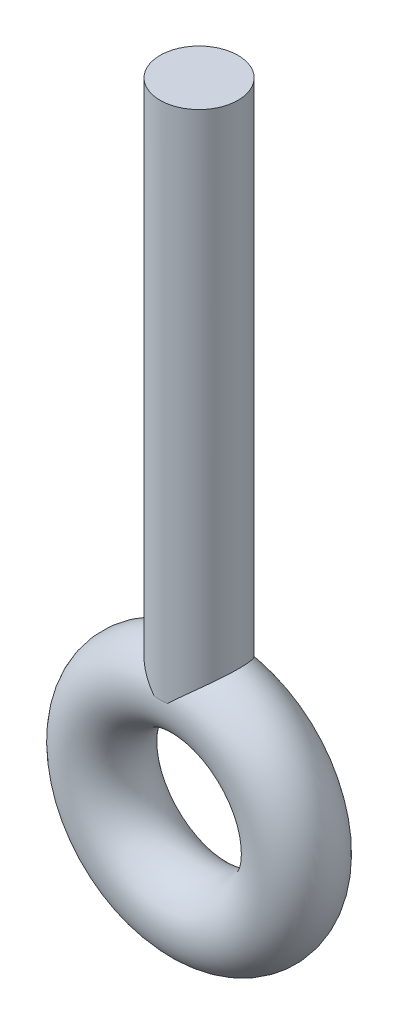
ISO-10303-21;
HEADER;
FILE_DESCRIPTION(('STEP AP214'),'2;1');
FILE_NAME('part.step','',(''),(''),'','','');
FILE_SCHEMA(('AUTOMOTIVE_DESIGN { 1 0 10303 214 1 1 1 1 }'));
ENDSEC;
DATA;
#1=APPLICATION_CONTEXT('core data for automotive mechanical design processes');
#2=APPLICATION_PROTOCOL_DEFINITION('international standard','automotive_design',2000,#1);
#3=PRODUCT_CONTEXT('',#1,'mechanical');
#4=PRODUCT('Part','Part','',(#3));
#5=PRODUCT_RELATED_PRODUCT_CATEGORY('part','',(#4));
#6=PRODUCT_DEFINITION_FORMATION('','',#4);
#7=PRODUCT_DEFINITION_CONTEXT('part definition',#1,'design');
#8=PRODUCT_DEFINITION('design','',#6,#7);
#9=PRODUCT_DEFINITION_SHAPE('','',#8);
#10=(LENGTH_UNIT() NAMED_UNIT(*) SI_UNIT(.MILLI.,.METRE.));
#11=(NAMED_UNIT(*) PLANE_ANGLE_UNIT() SI_UNIT($,.RADIAN.));
#12=(NAMED_UNIT(*) SI_UNIT($,.STERADIAN.) SOLID_ANGLE_UNIT());
#13=UNCERTAINTY_MEASURE_WITH_UNIT(LENGTH_MEASURE(1.E-05),#10,'distance_accuracy_value','');
#14=(GEOMETRIC_REPRESENTATION_CONTEXT(3) GLOBAL_UNCERTAINTY_ASSIGNED_CONTEXT((#13)) GLOBAL_UNIT_ASSIGNED_CONTEXT((#10,
#11,#12)) REPRESENTATION_CONTEXT('',''));
#15=CARTESIAN_POINT('',(0.,0.,0.));
#16=DIRECTION('',(0.,0.,1.));
#17=DIRECTION('',(1.,0.,0.));
#18=AXIS2_PLACEMENT_3D('',#15,#16,#17);
#19=CARTESIAN_POINT('',(0.,8.,0.));
#20=DIRECTION('',(0.,1.,0.));
#21=DIRECTION('',(0.,0.,1.));
#22=AXIS2_PLACEMENT_3D('',#19,#20,#21);
#23=PLANE('',#22);
#24=CARTESIAN_POINT('',(0.,8.,2.95803989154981));
#25=CARTESIAN_POINT('',(-0.247460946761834,8.,2.95804711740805));
#26=CARTESIAN_POINT('',(-0.49492265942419,8.,2.95616386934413));
#27=CARTESIAN_POINT('',(-0.989773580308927,8.,2.94788561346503));
#28=CARTESIAN_POINT('',(-1.23716279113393,8.,2.94149079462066));
#29=CARTESIAN_POINT('',(-1.60776807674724,8.,2.92679903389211));
#30=CARTESIAN_POINT('',(-1.731082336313,8.,2.92106134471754));
#31=CARTESIAN_POINT('',(-1.97758381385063,8.,2.90746047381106));
#32=CARTESIAN_POINT('',(-2.10077103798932,8.,2.89959740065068));
#33=CARTESIAN_POINT('',(-2.46998876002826,8.,2.87212468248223));
#34=CARTESIAN_POINT('',(-2.71577107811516,8.,2.84862845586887));
#35=CARTESIAN_POINT('',(-3.12136668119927,8.,2.79714191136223));
#36=CARTESIAN_POINT('',(-3.28172002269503,8.,2.77346517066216));
#37=CARTESIAN_POINT('',(-3.60098801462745,8.,2.71792496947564));
#38=CARTESIAN_POINT('',(-3.75990307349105,8.,2.68606391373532));
#39=CARTESIAN_POINT('',(-4.07526568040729,8.,2.61236064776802));
#40=CARTESIAN_POINT('',(-4.23171575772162,8.,2.57052948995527));
#41=CARTESIAN_POINT('',(-4.54085538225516,8.,2.47487456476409));
#42=CARTESIAN_POINT('',(-4.69354717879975,8.,2.42105817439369));
#43=CARTESIAN_POINT('',(-5.02114932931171,8.,2.28793160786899));
#44=CARTESIAN_POINT('',(-5.19492044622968,8.,2.20574311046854));
#45=CARTESIAN_POINT('',(-5.52939647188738,8.,2.01780762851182));
#46=CARTESIAN_POINT('',(-5.69011477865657,8.,1.91208522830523));
#47=CARTESIAN_POINT('',(-5.95753271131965,8.,1.70059309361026));
#48=CARTESIAN_POINT('',(-6.06831082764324,8.,1.60002476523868));
#49=CARTESIAN_POINT('',(-6.27238605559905,8.,1.38240612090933));
#50=CARTESIAN_POINT('',(-6.36570690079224,8.,1.26537856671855));
#51=CARTESIAN_POINT('',(-6.51329983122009,8.,1.04010634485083));
#52=CARTESIAN_POINT('',(-6.57163288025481,8.,0.934533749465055));
#53=CARTESIAN_POINT('',(-6.67002120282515,8.,0.715134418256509));
#54=CARTESIAN_POINT('',(-6.71008623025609,8.,0.601312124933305));
#55=CARTESIAN_POINT('',(-6.7694642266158,8.,0.367665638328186));
#56=CARTESIAN_POINT('',(-6.78866633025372,8.,0.247812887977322));
#57=CARTESIAN_POINT('',(-6.80446971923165,8.,0.00662180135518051));
#58=CARTESIAN_POINT('',(-6.80107644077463,8.,-0.114716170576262));
#59=CARTESIAN_POINT('',(-6.77326925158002,8.,-0.344084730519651));
#60=CARTESIAN_POINT('',(-6.75072472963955,8.,-0.452349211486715));
#61=CARTESIAN_POINT('',(-6.68849017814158,8.,-0.663777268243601));
#62=CARTESIAN_POINT('',(-6.64880041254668,8.,-0.766940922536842));
#63=CARTESIAN_POINT('',(-6.55241367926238,8.,-0.970289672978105));
#64=CARTESIAN_POINT('',(-6.49506970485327,8.,-1.07016536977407));
#65=CARTESIAN_POINT('',(-6.36682471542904,8.,-1.26077000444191));
#66=CARTESIAN_POINT('',(-6.29591319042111,8.,-1.35149176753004));
#67=CARTESIAN_POINT('',(-6.10249444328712,8.,-1.5689667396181));
#68=CARTESIAN_POINT('',(-5.97262185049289,8.,-1.68917707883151));
#69=CARTESIAN_POINT('',(-5.69547750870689,8.,-1.90730054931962));
#70=CARTESIAN_POINT('',(-5.54817808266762,8.,-2.00517746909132));
#71=CARTESIAN_POINT('',(-5.27463351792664,8.,-2.16223273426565));
#72=CARTESIAN_POINT('',(-5.1505221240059,8.,-2.22521772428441));
#73=CARTESIAN_POINT('',(-4.89720959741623,8.,-2.34010688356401));
#74=CARTESIAN_POINT('',(-4.76800491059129,8.,-2.39200314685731));
#75=CARTESIAN_POINT('',(-4.50575508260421,8.,-2.48618961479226));
#76=CARTESIAN_POINT('',(-4.37269965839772,8.,-2.52845077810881));
#77=CARTESIAN_POINT('',(-4.10430734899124,8.,-2.60450190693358));
#78=CARTESIAN_POINT('',(-3.96897180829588,8.,-2.6382966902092));
#79=CARTESIAN_POINT('',(-3.60023653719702,8.,-2.72014870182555));
#80=CARTESIAN_POINT('',(-3.36532021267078,8.,-2.76133707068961));
#81=CARTESIAN_POINT('',(-2.89325855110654,8.,-2.82842060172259));
#82=CARTESIAN_POINT('',(-2.65611139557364,8.,-2.85430194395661));
#83=CARTESIAN_POINT('',(-2.18011166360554,8.,-2.89539352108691));
#84=CARTESIAN_POINT('',(-1.94125602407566,8.,-2.91056627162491));
#85=CARTESIAN_POINT('',(-1.46330724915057,8.,-2.93368425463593));
#86=CARTESIAN_POINT('',(-1.22421421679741,8.,-2.94163184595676));
#87=CARTESIAN_POINT('',(-0.743847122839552,8.,-2.9527968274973));
#88=CARTESIAN_POINT('',(-0.502572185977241,8.,-2.95597245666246));
#89=CARTESIAN_POINT('',(-0.0199792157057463,8.,-2.95865902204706));
#90=CARTESIAN_POINT('',(0.221338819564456,8.,-2.95816957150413));
#91=CARTESIAN_POINT('',(0.70344713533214,8.,-2.95333444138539));
#92=CARTESIAN_POINT('',(0.944237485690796,8.,-2.94899665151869));
#93=CARTESIAN_POINT('',(1.42564383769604,8.,-2.93491469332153));
#94=CARTESIAN_POINT('',(1.66625985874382,8.,-2.92517126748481));
#95=CARTESIAN_POINT('',(2.14569930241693,8.,-2.89752531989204));
#96=CARTESIAN_POINT('',(2.38452518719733,8.,-2.8796690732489));
#97=CARTESIAN_POINT('',(2.86124761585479,8.,-2.83187784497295));
#98=CARTESIAN_POINT('',(3.09914322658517,8.,-2.80193287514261));
#99=CARTESIAN_POINT('',(3.56967012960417,8.,-2.72542663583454));
#100=CARTESIAN_POINT('',(3.8023305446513,8.,-2.67905220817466));
#101=CARTESIAN_POINT('',(4.26192487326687,8.,-2.56393752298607));
#102=CARTESIAN_POINT('',(4.48886813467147,8.,-2.49523672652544));
#103=CARTESIAN_POINT('',(4.86544771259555,8.,-2.35392675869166));
#104=CARTESIAN_POINT('',(5.01782302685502,8.,-2.2886947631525));
#105=CARTESIAN_POINT('',(5.31488130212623,8.,-2.14151619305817));
#106=CARTESIAN_POINT('',(5.45954577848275,8.,-2.05953154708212));
#107=CARTESIAN_POINT('',(5.73784718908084,8.,-1.8759752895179));
#108=CARTESIAN_POINT('',(5.87138064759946,8.,-1.77424407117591));
#109=CARTESIAN_POINT('',(6.11992064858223,8.,-1.55023382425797));
#110=CARTESIAN_POINT('',(6.23496748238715,8.,-1.42800070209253));
#111=CARTESIAN_POINT('',(6.41264946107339,8.,-1.19761963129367));
#112=CARTESIAN_POINT('',(6.4811444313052,8.,-1.09400485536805));
#113=CARTESIAN_POINT('',(6.60039535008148,8.,-0.87693884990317));
#114=CARTESIAN_POINT('',(6.65115958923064,8.,-0.76349224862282));
#115=CARTESIAN_POINT('',(6.73197157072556,8.,-0.528491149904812));
#116=CARTESIAN_POINT('',(6.76187746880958,8.,-0.406887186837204));
#117=CARTESIAN_POINT('',(6.79808596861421,8.,-0.160207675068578));
#118=CARTESIAN_POINT('',(6.80440053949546,8.,-0.0351339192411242));
#119=CARTESIAN_POINT('',(6.79356008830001,8.,0.200775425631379));
#120=CARTESIAN_POINT('',(6.77879605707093,8.,0.311729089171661));
#121=CARTESIAN_POINT('',(6.73097486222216,8.,0.529580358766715));
#122=CARTESIAN_POINT('',(6.69791817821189,8.,0.636478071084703));
#123=CARTESIAN_POINT('',(6.6150792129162,8.,0.844632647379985));
#124=CARTESIAN_POINT('',(6.56514823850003,8.,0.945829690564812));
#125=CARTESIAN_POINT('',(6.45116096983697,8.,1.13988097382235));
#126=CARTESIAN_POINT('',(6.38709704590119,8.,1.23273066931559));
#127=CARTESIAN_POINT('',(6.21446603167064,8.,1.45085834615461));
#128=CARTESIAN_POINT('',(6.09915290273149,8.,1.57080194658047));
#129=CARTESIAN_POINT('',(5.85077918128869,8.,1.79061235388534));
#130=CARTESIAN_POINT('',(5.71768391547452,8.,1.89043895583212));
#131=CARTESIAN_POINT('',(5.47280767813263,8.,2.04974334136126));
#132=CARTESIAN_POINT('',(5.36353175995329,8.,2.11316288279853));
#133=CARTESIAN_POINT('',(5.13979135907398,8.,2.23018643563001));
#134=CARTESIAN_POINT('',(5.02532374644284,8.,2.28378442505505));
#135=CARTESIAN_POINT('',(4.79250469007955,8.,2.38222673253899));
#136=CARTESIAN_POINT('',(4.67414714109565,8.,2.42705643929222));
#137=CARTESIAN_POINT('',(4.43483223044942,8.,2.50888202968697));
#138=CARTESIAN_POINT('',(4.31387580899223,8.,2.54588069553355));
#139=CARTESIAN_POINT('',(4.02321226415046,8.,2.62599579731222));
#140=CARTESIAN_POINT('',(3.8526491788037,8.,2.66599136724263));
#141=CARTESIAN_POINT('',(3.50934978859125,8.,2.73539836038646));
#142=CARTESIAN_POINT('',(3.33661230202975,8.,2.76480374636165));
#143=CARTESIAN_POINT('',(2.98953899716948,8.,2.81524361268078));
#144=CARTESIAN_POINT('',(2.81520039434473,8.,2.83625844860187));
#145=CARTESIAN_POINT('',(2.46591102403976,8.,2.8717230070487));
#146=CARTESIAN_POINT('',(2.29096036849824,8.,2.88617387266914));
#147=CARTESIAN_POINT('',(1.93972593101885,8.,2.91019183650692));
#148=CARTESIAN_POINT('',(1.76344027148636,8.,2.91973034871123));
#149=CARTESIAN_POINT('',(1.41071151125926,8.,2.93510926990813));
#150=CARTESIAN_POINT('',(1.23426840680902,8.,2.94094958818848));
#151=CARTESIAN_POINT('',(0.881533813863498,8.,2.94989268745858));
#152=CARTESIAN_POINT('',(0.705242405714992,8.,2.9529988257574));
#153=CARTESIAN_POINT('',(0.352634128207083,8.,2.95706986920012));
#154=CARTESIAN_POINT('',(0.176317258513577,8.,2.95803474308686));
#155=CARTESIAN_POINT('',(0.,8.,2.95803989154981));
#156=B_SPLINE_CURVE_WITH_KNOTS('',3,(#24,#25,#26,#27,#28,#29,#30,#31,#32,#33,#34,#35,#36,#37,
#38,#39,#40,#41,#42,#43,#44,#45,#46,#47,#48,#49,#50,#51,#52,#53,#54,#55,#56,#57,#58,#59,#60,#61,
#62,#63,#64,#65,#66,#67,#68,#69,#70,#71,#72,#73,#74,#75,#76,#77,#78,#79,#80,#81,#82,#83,#84,#85,
#86,#87,#88,#89,#90,#91,#92,#93,#94,#95,#96,#97,#98,#99,#100,#101,#102,#103,#104,#105,#106,#107,
#108,#109,#110,#111,#112,#113,#114,#115,#116,#117,#118,#119,#120,#121,#122,#123,#124,#125,#126,
#127,#128,#129,#130,#131,#132,#133,#134,#135,#136,#137,#138,#139,#140,#141,#142,#143,#144,#145,
#146,#147,#148,#149,#150,#151,#152,#153,#154,#155),.UNSPECIFIED.,.T.,.F.,(4,2,2,2,2,2,2,2,2,2,2,
2,2,2,2,2,2,2,2,2,2,2,2,2,2,2,2,2,2,2,2,2,2,2,2,2,2,2,2,2,2,2,2,2,2,2,2,2,2,2,2,2,2,2,2,2,2,2,2,
2,2,2,2,2,2,4),(0.,0.742377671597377,1.48472424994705,1.85504950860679,2.22535585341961,
2.96568123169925,3.45179511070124,3.93776632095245,4.42320129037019,4.90833829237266,
5.48356135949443,6.05818632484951,6.50548354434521,6.95216816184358,7.31254439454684,
7.67272798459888,8.03481636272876,8.39681762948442,8.72707505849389,9.05732740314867,
9.40151600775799,9.7459723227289,10.2738794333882,10.8026365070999,11.2195910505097,
11.6368418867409,12.0553342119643,12.4735878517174,13.1882955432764,13.9036475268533,
14.621491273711,15.3391005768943,16.0629540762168,16.7868839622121,17.5093330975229,
18.2316830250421,18.9499634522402,19.668838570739,20.3797877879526,21.0894872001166,
21.5859374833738,22.0835287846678,22.5853233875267,23.0860090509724,23.457203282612,
23.8282237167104,24.2017432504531,24.5750732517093,24.9092659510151,25.2434498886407,
25.5806588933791,25.9180503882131,26.4144159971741,26.911763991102,27.2902853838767,
27.6690380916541,28.0484166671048,28.427660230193,28.9527782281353,29.4781951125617,
30.0048350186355,30.5313831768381,31.0609617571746,31.590553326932,32.1194936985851,
32.6484417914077),.UNSPECIFIED.);
#157=CARTESIAN_POINT('',(-0.516666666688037,8.,-2.95517436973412));
#158=VERTEX_POINT('',#157);
#159=CARTESIAN_POINT('',(0.516666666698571,8.,-2.95517436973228));
#160=VERTEX_POINT('',#159);
#161=EDGE_CURVE('E11',#158,#160,#156,.T.);
#162=ORIENTED_EDGE('',*,*,#161,.F.);
#163=CARTESIAN_POINT('',(0.,8.,0.));
#164=DIRECTION('',(0.,1.,0.));
#165=DIRECTION('',(0.,0.,1.));
#166=AXIS2_PLACEMENT_3D('',#163,#164,#165);
#167=CIRCLE('',#166,3.);
#168=EDGE_CURVE('E85',#160,#158,#167,.T.);
#169=ORIENTED_EDGE('',*,*,#168,.F.);
#170=EDGE_LOOP('',(#162,#169));
#171=FACE_BOUND('',#170,.T.);
#172=ADVANCED_FACE('F37',(#171),#23,.F.);
#173=CARTESIAN_POINT('',(0.,48.,0.));
#174=DIRECTION('',(0.,-1.,0.));
#175=DIRECTION('',(0.,0.,-1.));
#176=AXIS2_PLACEMENT_3D('',#173,#174,#175);
#177=CYLINDRICAL_SURFACE('',#176,3.);
#178=CARTESIAN_POINT('',(0.516453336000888,7.99980000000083,-2.95521165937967));
#179=CARTESIAN_POINT('',(0.608004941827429,8.08563367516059,-2.93919241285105));
#180=CARTESIAN_POINT('',(0.699806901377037,8.17031465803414,-2.9187792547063));
#181=CARTESIAN_POINT('',(0.883410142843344,8.33715369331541,-2.86857108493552));
#182=CARTESIAN_POINT('',(0.975211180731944,8.41930741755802,-2.83876086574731));
#183=CARTESIAN_POINT('',(1.25073421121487,8.66240561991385,-2.73393456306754));
#184=CARTESIAN_POINT('',(1.43322654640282,8.81872902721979,-2.64373825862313));
#185=CARTESIAN_POINT('',(1.74150824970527,9.07661492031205,-2.44779812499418));
#186=CARTESIAN_POINT('',(1.87008404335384,9.182108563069,-2.3515495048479));
#187=CARTESIAN_POINT('',(2.11493421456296,9.37996427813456,-2.13394159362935));
#188=CARTESIAN_POINT('',(2.23125118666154,9.47237223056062,-2.01267389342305));
#189=CARTESIAN_POINT('',(2.42810748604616,9.62686718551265,-1.76769344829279));
#190=CARTESIAN_POINT('',(2.51137936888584,9.69144089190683,-1.64774749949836));
#191=CARTESIAN_POINT('',(2.66170556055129,9.80708592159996,-1.391856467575));
#192=CARTESIAN_POINT('',(2.72875620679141,9.85815419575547,-1.25590778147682));
#193=CARTESIAN_POINT('',(2.81431400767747,9.92296224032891,-1.04193621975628));
#194=CARTESIAN_POINT('',(2.84040225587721,9.94265263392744,-0.968631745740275));
#195=CARTESIAN_POINT('',(2.88701602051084,9.97775269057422,-0.819294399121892));
#196=CARTESIAN_POINT('',(2.9075442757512,9.99316446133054,-0.743262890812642));
#197=CARTESIAN_POINT('',(2.94265275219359,10.0194793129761,-0.589101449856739));
#198=CARTESIAN_POINT('',(2.95723530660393,10.0303841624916,-0.510972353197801));
#199=CARTESIAN_POINT('',(2.98018674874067,10.047530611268,-0.353330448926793));
#200=CARTESIAN_POINT('',(2.98855643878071,10.0537728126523,-0.27381782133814));
#201=CARTESIAN_POINT('',(3.00281617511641,10.0644082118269,-0.0534249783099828));
#202=CARTESIAN_POINT('',(3.00200186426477,10.0638014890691,0.0882248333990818));
#203=CARTESIAN_POINT('',(2.98054788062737,10.0477994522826,0.369048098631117));
#204=CARTESIAN_POINT('',(2.95991277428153,10.0324075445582,0.508222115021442));
#205=CARTESIAN_POINT('',(2.90117169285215,9.98839501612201,0.775410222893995));
#206=CARTESIAN_POINT('',(2.86369771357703,9.96025265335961,0.903644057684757));
#207=CARTESIAN_POINT('',(2.77346075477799,9.89207099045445,1.15121467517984));
#208=CARTESIAN_POINT('',(2.72069432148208,9.85202900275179,1.27054944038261));
#209=CARTESIAN_POINT('',(2.59768610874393,9.75795375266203,1.50702626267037));
#210=CARTESIAN_POINT('',(2.52641246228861,9.70308130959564,1.62329388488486));
#211=CARTESIAN_POINT('',(2.37199445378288,9.58298120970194,1.84161732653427));
#212=CARTESIAN_POINT('',(2.28884672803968,9.51775061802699,1.94366910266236));
#213=CARTESIAN_POINT('',(2.07723516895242,9.34976800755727,2.17217363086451));
#214=CARTESIAN_POINT('',(1.94425264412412,9.2426560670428,2.2912601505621));
#215=CARTESIAN_POINT('',(1.66693276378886,9.01482356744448,2.50033047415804));
#216=CARTESIAN_POINT('',(1.52255777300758,8.89405727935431,2.59021233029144));
#217=CARTESIAN_POINT('',(1.23438379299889,8.64755832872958,2.73888870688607));
#218=CARTESIAN_POINT('',(1.09080455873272,8.52223318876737,2.7988081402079));
#219=CARTESIAN_POINT('',(0.803303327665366,8.26535847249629,2.89437704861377));
#220=CARTESIAN_POINT('',(0.659393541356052,8.13386757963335,2.9302193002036));
#221=CARTESIAN_POINT('',(0.516453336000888,7.99980000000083,2.95521165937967));
#222=B_SPLINE_CURVE_WITH_KNOTS('',3,(#178,#179,#180,#181,#182,#183,#184,#185,#186,#187,#188,
#189,#190,#191,#192,#193,#194,#195,#196,#197,#198,#199,#200,#201,#202,#203,#204,#205,#206,#207,
#208,#209,#210,#211,#212,#213,#214,#215,#216,#217,#218,#219,#220,#221),.UNSPECIFIED.,.F.,.F.,(4,
2,2,2,2,2,2,2,2,2,2,2,2,2,2,2,2,2,2,2,2,4),(0.,0.379343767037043,0.759304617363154,
1.52473936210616,2.09918095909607,2.67155578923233,3.14865851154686,3.62586885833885,
3.86635774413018,4.10672795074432,4.34700374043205,4.58724849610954,5.0098499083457,
5.43235398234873,5.84017682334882,6.24809184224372,6.68737783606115,7.12678851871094,
7.74794672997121,8.37125055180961,8.96896149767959,9.5618278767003),.UNSPECIFIED.);
#223=CARTESIAN_POINT('',(0.516666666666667,8.,2.95517436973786));
#224=VERTEX_POINT('',#223);
#225=EDGE_CURVE('E42',#160,#224,#222,.T.);
#226=ORIENTED_EDGE('',*,*,#225,.F.);
#227=ORIENTED_EDGE('',*,*,#168,.T.);
#228=CARTESIAN_POINT('',(-0.516453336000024,7.99980000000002,2.95521165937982));
#229=CARTESIAN_POINT('',(-0.608004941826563,8.08563367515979,2.93919241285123));
#230=CARTESIAN_POINT('',(-0.699806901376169,8.17031465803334,2.91877925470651));
#231=CARTESIAN_POINT('',(-0.883410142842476,8.33715369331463,2.86857108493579));
#232=CARTESIAN_POINT('',(-0.975211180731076,8.41930741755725,2.83876086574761));
#233=CARTESIAN_POINT('',(-1.25073421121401,8.66240561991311,2.73393456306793));
#234=CARTESIAN_POINT('',(-1.43322654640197,8.81872902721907,2.64373825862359));
#235=CARTESIAN_POINT('',(-1.74150824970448,9.07661492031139,2.44779812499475));
#236=CARTESIAN_POINT('',(-1.8700840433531,9.18210856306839,2.35154950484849));
#237=CARTESIAN_POINT('',(-2.11493421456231,9.37996427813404,2.13394159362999));
#238=CARTESIAN_POINT('',(-2.23125118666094,9.47237223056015,2.01267389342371));
#239=CARTESIAN_POINT('',(-2.42810748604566,9.62686718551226,1.76769344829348));
#240=CARTESIAN_POINT('',(-2.51137936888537,9.69144089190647,1.64774749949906));
#241=CARTESIAN_POINT('',(-2.66170556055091,9.80708592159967,1.39185646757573));
#242=CARTESIAN_POINT('',(-2.72875620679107,9.85815419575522,1.25590778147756));
#243=CARTESIAN_POINT('',(-2.8143140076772,9.9229622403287,1.04193621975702));
#244=CARTESIAN_POINT('',(-2.84040225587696,9.94265263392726,0.968631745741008));
#245=CARTESIAN_POINT('',(-2.88701602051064,9.97775269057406,0.81929439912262));
#246=CARTESIAN_POINT('',(-2.90754427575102,9.99316446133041,0.743262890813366));
#247=CARTESIAN_POINT('',(-2.94265275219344,10.019479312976,0.589101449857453));
#248=CARTESIAN_POINT('',(-2.95723530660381,10.0303841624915,0.510972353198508));
#249=CARTESIAN_POINT('',(-2.98018674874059,10.047530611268,0.353330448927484));
#250=CARTESIAN_POINT('',(-2.98855643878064,10.0537728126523,0.273817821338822));
#251=CARTESIAN_POINT('',(-3.0028161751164,10.0644082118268,0.0534249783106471));
#252=CARTESIAN_POINT('',(-3.00200186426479,10.0638014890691,-0.0882248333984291));
#253=CARTESIAN_POINT('',(-2.98054788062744,10.0477994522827,-0.369048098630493));
#254=CARTESIAN_POINT('',(-2.95991277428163,10.0324075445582,-0.508222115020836));
#255=CARTESIAN_POINT('',(-2.90117169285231,9.98839501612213,-0.775410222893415));
#256=CARTESIAN_POINT('',(-2.86369771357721,9.96025265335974,-0.903644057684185));
#257=CARTESIAN_POINT('',(-2.77346075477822,9.89207099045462,-1.15121467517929));
#258=CARTESIAN_POINT('',(-2.72069432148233,9.85202900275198,-1.27054944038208));
#259=CARTESIAN_POINT('',(-2.59768610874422,9.75795375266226,-1.50702626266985));
#260=CARTESIAN_POINT('',(-2.52641246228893,9.70308130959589,-1.62329388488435));
#261=CARTESIAN_POINT('',(-2.37199445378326,9.58298120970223,-1.84161732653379));
#262=CARTESIAN_POINT('',(-2.28884672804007,9.5177506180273,-1.94366910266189));
#263=CARTESIAN_POINT('',(-2.07723516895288,9.34976800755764,-2.17217363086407));
#264=CARTESIAN_POINT('',(-1.94425264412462,9.2426560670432,-2.29126015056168));
#265=CARTESIAN_POINT('',(-1.66693276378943,9.01482356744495,-2.50033047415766));
#266=CARTESIAN_POINT('',(-1.52255777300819,8.89405727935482,-2.59021233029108));
#267=CARTESIAN_POINT('',(-1.23438379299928,8.64755832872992,-2.73888870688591));
#268=CARTESIAN_POINT('',(-1.09080455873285,8.5222331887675,-2.79880814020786));
#269=CARTESIAN_POINT('',(-0.803303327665,8.26535847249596,-2.89437704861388));
#270=CARTESIAN_POINT('',(-0.659393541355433,8.13386757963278,-2.93021930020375));
#271=CARTESIAN_POINT('',(-0.516453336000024,7.99980000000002,-2.95521165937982));
#272=B_SPLINE_CURVE_WITH_KNOTS('',3,(#228,#229,#230,#231,#232,#233,#234,#235,#236,#237,#238,
#239,#240,#241,#242,#243,#244,#245,#246,#247,#248,#249,#250,#251,#252,#253,#254,#255,#256,#257,
#258,#259,#260,#261,#262,#263,#264,#265,#266,#267,#268,#269,#270,#271),.UNSPECIFIED.,.F.,.F.,(4,
2,2,2,2,2,2,2,2,2,2,2,2,2,2,2,2,2,2,2,2,4),(0.,0.379343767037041,0.759304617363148,
1.52473936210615,2.09918095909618,2.67155578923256,3.14865851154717,3.62586885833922,
3.86635774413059,4.10672795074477,4.34700374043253,4.58724849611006,5.00984990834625,
5.43235398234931,5.8401768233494,6.24809184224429,6.68737783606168,7.12678851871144,
7.74794672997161,8.37125055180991,8.96896149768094,9.56182787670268),.UNSPECIFIED.);
#273=CARTESIAN_POINT('',(-0.516666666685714,8.,2.95517436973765));
#274=VERTEX_POINT('',#273);
#275=EDGE_CURVE('E79',#274,#158,#272,.T.);
#276=ORIENTED_EDGE('',*,*,#275,.F.);
#277=EDGE_CURVE('E60',#274,#224,#167,.T.);
#278=ORIENTED_EDGE('',*,*,#277,.T.);
#279=EDGE_LOOP('',(#226,#227,#276,#278));
#280=FACE_BOUND('',#279,.T.);
#281=CARTESIAN_POINT('',(0.,48.,0.));
#282=DIRECTION('',(0.,1.,0.));
#283=DIRECTION('',(0.,0.,1.));
#284=AXIS2_PLACEMENT_3D('',#281,#282,#283);
#285=CIRCLE('',#284,3.);
#286=CARTESIAN_POINT('',(0.,48.,3.));
#287=VERTEX_POINT('',#286);
#288=EDGE_CURVE('E80',#287,#287,#285,.T.);
#289=ORIENTED_EDGE('',*,*,#288,.F.);
#290=EDGE_LOOP('',(#289));
#291=FACE_BOUND('',#290,.T.);
#292=ADVANCED_FACE('F82',(#280,#291),#177,.T.);
#293=CARTESIAN_POINT('',(0.,48.,0.));
#294=DIRECTION('',(0.,1.,0.));
#295=DIRECTION('',(0.,0.,1.));
#296=AXIS2_PLACEMENT_3D('',#293,#294,#295);
#297=PLANE('',#296);
#298=ORIENTED_EDGE('',*,*,#288,.T.);
#299=EDGE_LOOP('',(#298));
#300=FACE_BOUND('',#299,.T.);
#301=ADVANCED_FACE('F97',(#300),#297,.T.);
#302=EDGE_CURVE('E52',#224,#274,#156,.T.);
#303=ORIENTED_EDGE('',*,*,#302,.F.);
#304=ORIENTED_EDGE('',*,*,#277,.F.);
#305=EDGE_LOOP('',(#303,#304));
#306=FACE_BOUND('',#305,.T.);
#307=ADVANCED_FACE('F74',(#306),#23,.F.);
#308=CARTESIAN_POINT('',(0.,0.,0.));
#309=DIRECTION('',(0.,0.,-1.));
#310=DIRECTION('',(-1.,0.,0.));
#311=AXIS2_PLACEMENT_3D('',#308,#309,#310);
#312=TOROIDAL_SURFACE('',#311,7.5,3.);
#313=ORIENTED_EDGE('',*,*,#275,.T.);
#314=ORIENTED_EDGE('',*,*,#161,.T.);
#315=ORIENTED_EDGE('',*,*,#225,.T.);
#316=ORIENTED_EDGE('',*,*,#302,.T.);
#317=EDGE_LOOP('',(#313,#314,#315,#316));
#318=FACE_BOUND('',#317,.T.);
#319=ADVANCED_FACE('F39',(#318),#312,.T.);
#320=CLOSED_SHELL('',(#172,#292,#301,#307,#319));
#321=MANIFOLD_SOLID_BREP('B2',#320);
#322=ADVANCED_BREP_SHAPE_REPRESENTATION('',(#18,#321),#14);
#323=SHAPE_DEFINITION_REPRESENTATION(#9,#322);
ENDSEC;
END-ISO-10303-21;
